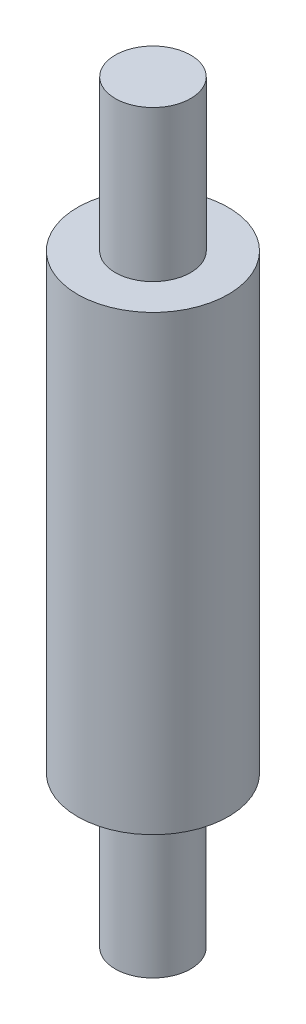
from build123d import *

# Parameters (mm, degrees)
SKETCH1_R      = 3
EXTRUDE1_DEPTH = 18
SKETCH2_R      = 1.5
EXTRUDE2_DEPTH = 6
EXTRUDE3_START = 6
SKETCH3_R      = 1.5
EXTRUDE3_DEPTH = 6


with BuildPart() as part:
    # Sketch1 → Extrude1 (new body)
    with BuildSketch(Plane(origin=(0, 0, 0), x_dir=(1, 0, 0), z_dir=(0, 1, 0))):
        with Locations(Location((0, 0, 0), (0, 0, 270))):
            Circle(SKETCH1_R)
    extrude(amount=EXTRUDE1_DEPTH)

    # Sketch2 → Extrude2 (add)
    with BuildSketch(Plane(origin=(0, 18, 0), x_dir=(-1, 0, 0), z_dir=(0, 1, 0))):
        with Locations(Location((0, 0, 0), (0, 0, 90))):
            Circle(SKETCH2_R)
    extrude(amount=EXTRUDE2_DEPTH)

    # Sketch3 → Extrude3 (add)
    with BuildSketch(Plane.XZ.offset(EXTRUDE3_START)):
        with Locations(Location((0, 0, 0), (0, 0, 90))):
            Circle(SKETCH3_R)
    extrude(amount=-EXTRUDE3_DEPTH)


solid = part.part
